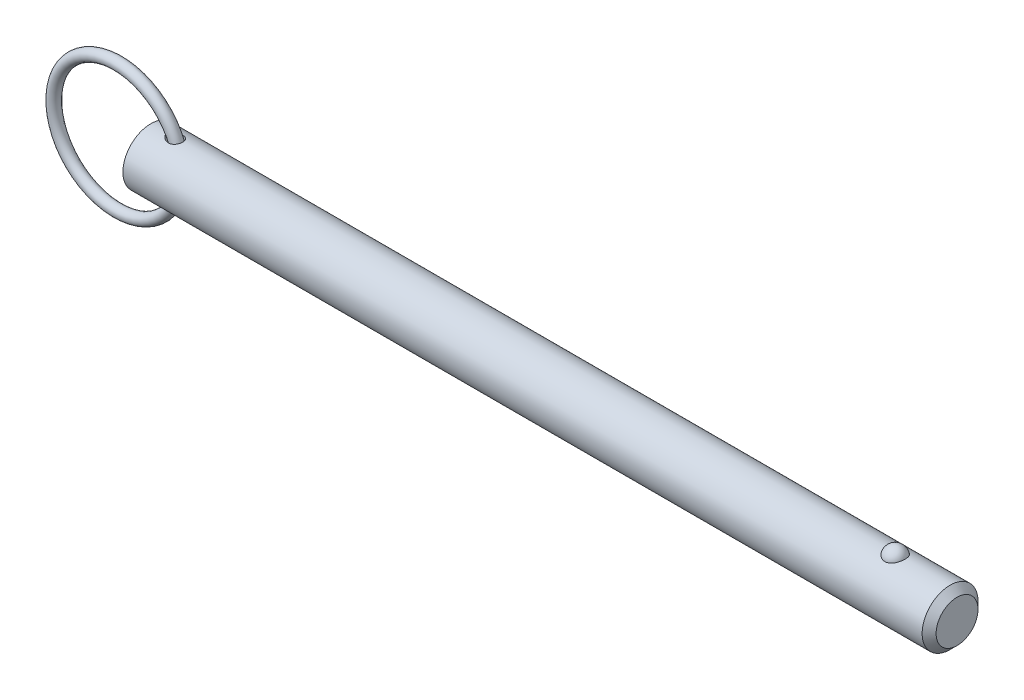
ISO-10303-21;
HEADER;
FILE_DESCRIPTION(('STEP AP214'),'2;1');
FILE_NAME('part.step','',(''),(''),'','','');
FILE_SCHEMA(('AUTOMOTIVE_DESIGN { 1 0 10303 214 1 1 1 1 }'));
ENDSEC;
DATA;
#1=APPLICATION_CONTEXT('core data for automotive mechanical design processes');
#2=APPLICATION_PROTOCOL_DEFINITION('international standard','automotive_design',2000,#1);
#3=PRODUCT_CONTEXT('',#1,'mechanical');
#4=PRODUCT('Part','Part','',(#3));
#5=PRODUCT_RELATED_PRODUCT_CATEGORY('part','',(#4));
#6=PRODUCT_DEFINITION_FORMATION('','',#4);
#7=PRODUCT_DEFINITION_CONTEXT('part definition',#1,'design');
#8=PRODUCT_DEFINITION('design','',#6,#7);
#9=PRODUCT_DEFINITION_SHAPE('','',#8);
#10=(LENGTH_UNIT() NAMED_UNIT(*) SI_UNIT(.MILLI.,.METRE.));
#11=(NAMED_UNIT(*) PLANE_ANGLE_UNIT() SI_UNIT($,.RADIAN.));
#12=(NAMED_UNIT(*) SI_UNIT($,.STERADIAN.) SOLID_ANGLE_UNIT());
#13=UNCERTAINTY_MEASURE_WITH_UNIT(LENGTH_MEASURE(1.E-05),#10,'distance_accuracy_value','');
#14=(GEOMETRIC_REPRESENTATION_CONTEXT(3) GLOBAL_UNCERTAINTY_ASSIGNED_CONTEXT((#13)) GLOBAL_UNIT_ASSIGNED_CONTEXT((#10,
#11,#12)) REPRESENTATION_CONTEXT('',''));
#15=CARTESIAN_POINT('',(0.,0.,0.));
#16=DIRECTION('',(0.,0.,1.));
#17=DIRECTION('',(1.,0.,0.));
#18=AXIS2_PLACEMENT_3D('',#15,#16,#17);
#19=CARTESIAN_POINT('',(-6.5973878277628,0.,0.));
#20=DIRECTION('',(0.,0.,1.));
#21=DIRECTION('',(1.,0.,0.));
#22=AXIS2_PLACEMENT_3D('',#19,#20,#21);
#23=TOROIDAL_SURFACE('',#22,12.7,1.111);
#24=CARTESIAN_POINT('',(7.21361217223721,0.,0.));
#25=VERTEX_POINT('',#24);
#26=VERTEX_LOOP('',#25);
#27=FACE_BOUND('',#26,.T.);
#28=ADVANCED_FACE('P0_F12',(#27),#23,.T.);
#29=CLOSED_SHELL('',(#28));
#30=MANIFOLD_SOLID_BREP('P0_B1',#29);
#31=CARTESIAN_POINT('',(0.,0.,0.));
#32=DIRECTION('',(1.,0.,0.));
#33=DIRECTION('',(0.,0.,-1.));
#34=AXIS2_PLACEMENT_3D('',#31,#32,#33);
#35=CYLINDRICAL_SURFACE('',#34,5.555);
#36=CARTESIAN_POINT('',(3.4079629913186,5.52646850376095,-0.56229074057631));
#37=CARTESIAN_POINT('',(3.45038002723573,5.51879026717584,-0.637753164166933));
#38=CARTESIAN_POINT('',(3.50032814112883,5.50998541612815,-0.70889136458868));
#39=CARTESIAN_POINT('',(3.61174203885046,5.49132550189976,-0.841353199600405));
#40=CARTESIAN_POINT('',(3.67323300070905,5.48146816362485,-0.902654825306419));
#41=CARTESIAN_POINT('',(3.80437942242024,5.46186986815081,-1.01449227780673));
#42=CARTESIAN_POINT('',(3.87396236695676,5.45212862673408,-1.06511378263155));
#43=CARTESIAN_POINT('',(4.01965973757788,5.43359578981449,-1.15594541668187));
#44=CARTESIAN_POINT('',(4.09577226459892,5.42480391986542,-1.19615855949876));
#45=CARTESIAN_POINT('',(4.26620236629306,5.40764958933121,-1.27165209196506));
#46=CARTESIAN_POINT('',(4.36143030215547,5.3996073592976,-1.30496908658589));
#47=CARTESIAN_POINT('',(4.55632904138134,5.38707461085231,-1.35578120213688));
#48=CARTESIAN_POINT('',(4.65600230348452,5.38258608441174,-1.37326745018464));
#49=CARTESIAN_POINT('',(4.85802759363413,5.37803111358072,-1.3910078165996));
#50=CARTESIAN_POINT('',(4.96039620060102,5.37800782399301,-1.39109376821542));
#51=CARTESIAN_POINT('',(5.16321961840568,5.38288845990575,-1.37209481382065));
#52=CARTESIAN_POINT('',(5.2636766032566,5.38778639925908,-1.3530331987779));
#53=CARTESIAN_POINT('',(5.44616808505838,5.40112654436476,-1.29866014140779));
#54=CARTESIAN_POINT('',(5.52893514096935,5.40904875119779,-1.26567968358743));
#55=CARTESIAN_POINT('',(5.68656142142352,5.4273273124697,-1.18484144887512));
#56=CARTESIAN_POINT('',(5.76142575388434,5.43768208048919,-1.13699336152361));
#57=CARTESIAN_POINT('',(5.8928378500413,5.45821422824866,-1.03362464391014));
#58=CARTESIAN_POINT('',(5.95048930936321,5.4682911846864,-0.979480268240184));
#59=CARTESIAN_POINT('',(6.05543937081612,5.48805232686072,-0.861887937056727));
#60=CARTESIAN_POINT('',(6.10274018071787,5.4977365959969,-0.798441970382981));
#61=CARTESIAN_POINT('',(6.18429732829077,5.51527779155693,-0.666351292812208));
#62=CARTESIAN_POINT('',(6.21893047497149,5.52318421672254,-0.597945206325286));
#63=CARTESIAN_POINT('',(6.27643902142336,5.53669785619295,-0.456146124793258));
#64=CARTESIAN_POINT('',(6.299314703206,5.54230512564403,-0.382753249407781));
#65=CARTESIAN_POINT('',(6.33280284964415,5.55061821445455,-0.232999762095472));
#66=CARTESIAN_POINT('',(6.34340498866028,5.55332159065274,-0.156636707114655));
#67=CARTESIAN_POINT('',(6.35208224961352,5.55552923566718,-0.00315477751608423));
#68=CARTESIAN_POINT('',(6.3501570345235,5.55503341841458,0.0739641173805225));
#69=CARTESIAN_POINT('',(6.33379320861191,5.55088854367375,0.22702996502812));
#70=CARTESIAN_POINT('',(6.31931424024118,5.54722931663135,0.302972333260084));
#71=CARTESIAN_POINT('',(6.27810810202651,5.53713917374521,0.451265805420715));
#72=CARTESIAN_POINT('',(6.25138106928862,5.53070828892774,0.523616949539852));
#73=CARTESIAN_POINT('',(6.18634700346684,5.51578851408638,0.662556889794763));
#74=CARTESIAN_POINT('',(6.14805666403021,5.50730259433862,0.729153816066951));
#75=CARTESIAN_POINT('',(6.0608417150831,5.4892059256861,0.854797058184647));
#76=CARTESIAN_POINT('',(6.01191805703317,5.47959527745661,0.91384404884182));
#77=CARTESIAN_POINT('',(5.90496974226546,5.46035411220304,1.0225462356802));
#78=CARTESIAN_POINT('',(5.8469816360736,5.45072382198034,1.07223745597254));
#79=CARTESIAN_POINT('',(5.72342907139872,5.43245016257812,1.16128533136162));
#80=CARTESIAN_POINT('',(5.65786492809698,5.42380675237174,1.20064241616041));
#81=CARTESIAN_POINT('',(5.52033184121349,5.40830592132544,1.26865612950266));
#82=CARTESIAN_POINT('',(5.44830127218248,5.40146883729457,1.2971923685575));
#83=CARTESIAN_POINT('',(5.30051649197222,5.39032432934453,1.34275086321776));
#84=CARTESIAN_POINT('',(5.2247613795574,5.38601752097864,1.35977031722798));
#85=CARTESIAN_POINT('',(5.06697568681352,5.38004503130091,1.3832203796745));
#86=CARTESIAN_POINT('',(4.98483834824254,5.37854992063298,1.38896799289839));
#87=CARTESIAN_POINT('',(4.82062075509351,5.37866467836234,1.38851901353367));
#88=CARTESIAN_POINT('',(4.73854053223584,5.38027567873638,1.38231806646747));
#89=CARTESIAN_POINT('',(4.5665970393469,5.38661928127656,1.35740374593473));
#90=CARTESIAN_POINT('',(4.47694676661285,5.39169506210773,1.33731128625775));
#91=CARTESIAN_POINT('',(4.30168169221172,5.40457769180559,1.28425210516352));
#92=CARTESIAN_POINT('',(4.2160714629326,5.41238755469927,1.25127117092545));
#93=CARTESIAN_POINT('',(4.04117722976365,5.43085841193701,1.16867508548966));
#94=CARTESIAN_POINT('',(3.95261220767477,5.44174460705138,1.11757796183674));
#95=CARTESIAN_POINT('',(3.78568183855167,5.46440376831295,1.00091858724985));
#96=CARTESIAN_POINT('',(3.70730710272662,5.47617590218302,0.935369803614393));
#97=CARTESIAN_POINT('',(3.5829937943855,5.49603821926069,0.809043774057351));
#98=CARTESIAN_POINT('',(3.5339020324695,5.50429522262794,0.751392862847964));
#99=CARTESIAN_POINT('',(3.44556991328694,5.51963490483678,0.628847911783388));
#100=CARTESIAN_POINT('',(3.40631385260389,5.52671944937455,0.563965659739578));
#101=CARTESIAN_POINT('',(3.34553998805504,5.5379053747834,0.439181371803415));
#102=CARTESIAN_POINT('',(3.32216705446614,5.5423057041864,0.380214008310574));
#103=CARTESIAN_POINT('',(3.28543686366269,5.54928356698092,0.259119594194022));
#104=CARTESIAN_POINT('',(3.27207322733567,5.5518622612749,0.196994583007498));
#105=CARTESIAN_POINT('',(3.25633559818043,5.5549036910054,0.0710541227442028));
#106=CARTESIAN_POINT('',(3.25400356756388,5.5553583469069,0.00723314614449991));
#107=CARTESIAN_POINT('',(3.26064251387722,5.55407150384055,-0.119787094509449));
#108=CARTESIAN_POINT('',(3.26961302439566,5.55233009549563,-0.182986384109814));
#109=CARTESIAN_POINT('',(3.29666795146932,5.54714559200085,-0.300518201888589));
#110=CARTESIAN_POINT('',(3.31373453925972,5.54389322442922,-0.355099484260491));
#111=CARTESIAN_POINT('',(3.35543396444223,5.53607951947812,-0.461174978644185));
#112=CARTESIAN_POINT('',(3.38007019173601,5.5315175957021,-0.512667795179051));
#113=CARTESIAN_POINT('',(3.4079629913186,5.52646850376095,-0.56229074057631));
#114=B_SPLINE_CURVE_WITH_KNOTS('',3,(#36,#37,#38,#39,#40,#41,#42,#43,#44,#45,#46,#47,#48,#49,
#50,#51,#52,#53,#54,#55,#56,#57,#58,#59,#60,#61,#62,#63,#64,#65,#66,#67,#68,#69,#70,#71,#72,#73,
#74,#75,#76,#77,#78,#79,#80,#81,#82,#83,#84,#85,#86,#87,#88,#89,#90,#91,#92,#93,#94,#95,#96,#97,
#98,#99,#100,#101,#102,#103,#104,#105,#106,#107,#108,#109,#110,#111,#112,#113),.UNSPECIFIED.,
.T.,.F.,(4,2,2,2,2,2,2,2,2,2,2,2,2,2,2,2,2,2,2,2,2,2,2,2,2,2,2,2,2,2,2,2,2,2,2,2,2,2,4),(0.,
0.260459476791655,0.521493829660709,0.780346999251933,1.03912513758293,1.34137402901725,
1.64379222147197,1.94913302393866,2.25410286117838,2.52092363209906,2.78757087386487,
3.02557563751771,3.26352958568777,3.49368251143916,3.72382991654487,3.9541708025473,
4.18451788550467,4.41560824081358,4.64669600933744,4.87745174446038,5.10818684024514,
5.33801446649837,5.56783253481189,5.80013729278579,6.03249854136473,6.27855081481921,
6.5246927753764,6.79963372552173,7.07487872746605,7.38193573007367,7.68870779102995,
7.91639390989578,8.14371416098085,8.33366541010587,8.52349549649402,8.71404708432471,
8.90459080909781,9.07578823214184,9.24706243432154),.UNSPECIFIED.);
#115=CARTESIAN_POINT('',(3.4079629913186,5.52646850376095,-0.56229074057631));
#116=VERTEX_POINT('',#115);
#117=EDGE_CURVE('P1_E40',#116,#116,#114,.T.);
#118=ORIENTED_EDGE('',*,*,#117,.T.);
#119=EDGE_LOOP('',(#118));
#120=FACE_BOUND('',#119,.T.);
#121=CARTESIAN_POINT('',(158.93125,0.,0.));
#122=DIRECTION('',(1.,0.,0.));
#123=DIRECTION('',(0.,0.,-1.));
#124=AXIS2_PLACEMENT_3D('',#121,#122,#123);
#125=CIRCLE('',#124,5.555);
#126=CARTESIAN_POINT('',(158.93125,0.,-5.555));
#127=VERTEX_POINT('',#126);
#128=EDGE_CURVE('P1_E25',#127,#127,#125,.T.);
#129=ORIENTED_EDGE('',*,*,#128,.F.);
#130=EDGE_LOOP('',(#129));
#131=FACE_BOUND('',#130,.T.);
#132=CARTESIAN_POINT('',(0.,0.,0.));
#133=DIRECTION('',(1.,0.,0.));
#134=DIRECTION('',(0.,0.,-1.));
#135=AXIS2_PLACEMENT_3D('',#132,#133,#134);
#136=CIRCLE('',#135,5.555);
#137=CARTESIAN_POINT('',(0.,0.,-5.555));
#138=VERTEX_POINT('',#137);
#139=EDGE_CURVE('P1_E9',#138,#138,#136,.T.);
#140=ORIENTED_EDGE('',*,*,#139,.T.);
#141=EDGE_LOOP('',(#140));
#142=FACE_BOUND('',#141,.T.);
#143=CARTESIAN_POINT('',(148.018626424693,5.16741224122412,2.03859650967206));
#144=CARTESIAN_POINT('',(147.912949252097,5.16740893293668,2.03859990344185));
#145=CARTESIAN_POINT('',(147.80729894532,5.17079470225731,2.03008306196));
#146=CARTESIAN_POINT('',(147.599141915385,5.18392795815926,1.99630721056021));
#147=CARTESIAN_POINT('',(147.496634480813,5.19367399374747,1.97105201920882));
#148=CARTESIAN_POINT('',(147.297771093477,5.21839168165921,1.90463997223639));
#149=CARTESIAN_POINT('',(147.201406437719,5.23335573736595,1.8635062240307));
#150=CARTESIAN_POINT('',(147.017080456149,5.26688076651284,1.76652592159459));
#151=CARTESIAN_POINT('',(146.929120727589,5.28544242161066,1.71067657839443));
#152=CARTESIAN_POINT('',(146.761265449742,5.32479845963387,1.58399959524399));
#153=CARTESIAN_POINT('',(146.68166564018,5.34564089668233,1.51279545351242));
#154=CARTESIAN_POINT('',(146.53512901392,5.38697258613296,1.35828584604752));
#155=CARTESIAN_POINT('',(146.468194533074,5.40746177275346,1.27497815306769));
#156=CARTESIAN_POINT('',(146.34561039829,5.44694508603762,1.0944029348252));
#157=CARTESIAN_POINT('',(146.290598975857,5.46583143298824,0.996677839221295));
#158=CARTESIAN_POINT('',(146.196937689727,5.49908030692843,0.792961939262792));
#159=CARTESIAN_POINT('',(146.158289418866,5.513442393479,0.686970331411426));
#160=CARTESIAN_POINT('',(146.097680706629,5.53635851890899,0.468019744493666));
#161=CARTESIAN_POINT('',(146.075972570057,5.54482455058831,0.354981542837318));
#162=CARTESIAN_POINT('',(146.050636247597,5.55473324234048,0.126595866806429));
#163=CARTESIAN_POINT('',(146.047007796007,5.55617600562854,0.0112484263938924));
#164=CARTESIAN_POINT('',(146.057881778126,5.55189984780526,-0.218011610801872));
#165=CARTESIAN_POINT('',(146.072315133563,5.54620821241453,-0.331928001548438));
#166=CARTESIAN_POINT('',(146.118903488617,5.52828920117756,-0.555544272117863));
#167=CARTESIAN_POINT('',(146.151058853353,5.5160616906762,-0.665244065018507));
#168=CARTESIAN_POINT('',(146.232488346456,5.48630779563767,-0.877469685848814));
#169=CARTESIAN_POINT('',(146.281781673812,5.4687754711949,-0.979987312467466));
#170=CARTESIAN_POINT('',(146.396478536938,5.43024700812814,-1.17486975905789));
#171=CARTESIAN_POINT('',(146.461883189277,5.4092506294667,-1.26723387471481));
#172=CARTESIAN_POINT('',(146.607571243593,5.36600927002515,-1.4394013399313));
#173=CARTESIAN_POINT('',(146.687885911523,5.34376173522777,-1.51917763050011));
#174=CARTESIAN_POINT('',(146.861452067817,5.30057971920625,-1.66360338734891));
#175=CARTESIAN_POINT('',(146.954702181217,5.27964509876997,-1.72825445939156));
#176=CARTESIAN_POINT('',(147.149393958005,5.24205250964,-1.83909478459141));
#177=CARTESIAN_POINT('',(147.250590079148,5.22530519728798,-1.88568407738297));
#178=CARTESIAN_POINT('',(147.460155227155,5.19750919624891,-1.96100802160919));
#179=CARTESIAN_POINT('',(147.568521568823,5.1864583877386,-1.98974931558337));
#180=CARTESIAN_POINT('',(147.783498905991,5.17184410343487,-2.02742262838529));
#181=CARTESIAN_POINT('',(147.889925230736,5.1679328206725,-2.03727608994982));
#182=CARTESIAN_POINT('',(148.102992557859,5.16698995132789,-2.03966777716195));
#183=CARTESIAN_POINT('',(148.209633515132,5.16995704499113,-2.03220932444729));
#184=CARTESIAN_POINT('',(148.416773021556,5.18222383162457,-2.00071170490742));
#185=CARTESIAN_POINT('',(148.517359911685,5.19133213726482,-1.97717337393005));
#186=CARTESIAN_POINT('',(148.713014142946,5.21467637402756,-1.91475248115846));
#187=CARTESIAN_POINT('',(148.808081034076,5.22891272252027,-1.87586867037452));
#188=CARTESIAN_POINT('',(148.992371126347,5.26137066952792,-1.78282713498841));
#189=CARTESIAN_POINT('',(149.081419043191,5.27967329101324,-1.72835124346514));
#190=CARTESIAN_POINT('',(149.249288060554,5.3181741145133,-1.60597483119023));
#191=CARTESIAN_POINT('',(149.328106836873,5.33837274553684,-1.5380712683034));
#192=CARTESIAN_POINT('',(149.477515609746,5.37968287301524,-1.38688970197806));
#193=CARTESIAN_POINT('',(149.547505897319,5.40079011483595,-1.30301744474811));
#194=CARTESIAN_POINT('',(149.673012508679,5.44074401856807,-1.12458170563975));
#195=CARTESIAN_POINT('',(149.728526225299,5.45959027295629,-1.03001630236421));
#196=CARTESIAN_POINT('',(149.825550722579,5.49369849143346,-0.829439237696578));
#197=CARTESIAN_POINT('',(149.866548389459,5.50882422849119,-0.723155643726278));
#198=CARTESIAN_POINT('',(149.931125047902,5.53310911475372,-0.504772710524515));
#199=CARTESIAN_POINT('',(149.954703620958,5.54226812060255,-0.392673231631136));
#200=CARTESIAN_POINT('',(149.984013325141,5.55370358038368,-0.165459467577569));
#201=CARTESIAN_POINT('',(149.989688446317,5.55595843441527,-0.0503368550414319));
#202=CARTESIAN_POINT('',(149.982916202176,5.55329317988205,0.179288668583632));
#203=CARTESIAN_POINT('',(149.970469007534,5.54837313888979,0.293791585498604));
#204=CARTESIAN_POINT('',(149.927779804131,5.53189037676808,0.518526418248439));
#205=CARTESIAN_POINT('',(149.897598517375,5.5203503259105,0.628771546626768));
#206=CARTESIAN_POINT('',(149.820096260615,5.49182453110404,0.84231815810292));
#207=CARTESIAN_POINT('',(149.772774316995,5.47483847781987,0.945619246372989));
#208=CARTESIAN_POINT('',(149.661720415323,5.43710633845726,1.14281571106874));
#209=CARTESIAN_POINT('',(149.597921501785,5.41634501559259,1.23667048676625));
#210=CARTESIAN_POINT('',(149.455357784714,5.37334572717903,1.4118524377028));
#211=CARTESIAN_POINT('',(149.37659323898,5.35110778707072,1.49317982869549));
#212=CARTESIAN_POINT('',(149.206423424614,5.30779474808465,1.64049162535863));
#213=CARTESIAN_POINT('',(149.11510026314,5.28671324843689,1.7065687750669));
#214=CARTESIAN_POINT('',(148.921739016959,5.24804852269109,1.82201372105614));
#215=CARTESIAN_POINT('',(148.819700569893,5.23046541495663,1.87138095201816));
#216=CARTESIAN_POINT('',(148.603618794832,5.20042692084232,1.95335298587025));
#217=CARTESIAN_POINT('',(148.489260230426,5.18820192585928,1.98521734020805));
#218=CARTESIAN_POINT('',(148.256130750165,5.17169804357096,2.02783294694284));
#219=CARTESIAN_POINT('',(148.137361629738,5.16741595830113,2.03859269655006));
#220=CARTESIAN_POINT('',(148.018626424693,5.16741224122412,2.03859650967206));
#221=B_SPLINE_CURVE_WITH_KNOTS('',3,(#143,#144,#145,#146,#147,#148,#149,#150,#151,#152,#153,
#154,#155,#156,#157,#158,#159,#160,#161,#162,#163,#164,#165,#166,#167,#168,#169,#170,#171,#172,
#173,#174,#175,#176,#177,#178,#179,#180,#181,#182,#183,#184,#185,#186,#187,#188,#189,#190,#191,
#192,#193,#194,#195,#196,#197,#198,#199,#200,#201,#202,#203,#204,#205,#206,#207,#208,#209,#210,
#211,#212,#213,#214,#215,#216,#217,#218,#219,#220),.UNSPECIFIED.,.T.,.F.,(4,2,2,2,2,2,2,2,2,2,2,
2,2,2,2,2,2,2,2,2,2,2,2,2,2,2,2,2,2,2,2,2,2,2,2,2,2,2,4),(0.,0.316595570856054,
0.633118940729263,0.94918341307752,1.26530783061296,1.59030762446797,1.91536729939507,
2.25495824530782,2.59458224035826,2.93917283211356,3.28375835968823,3.62703002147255,
3.97030875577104,4.31397329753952,4.657661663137,5.00207904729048,5.34645984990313,
5.68270547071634,6.01882587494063,6.33808403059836,6.65728093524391,6.96696376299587,
7.27667180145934,7.59321535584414,7.90983070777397,8.24210387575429,8.57443684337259,
8.91755896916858,9.26068933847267,9.60489211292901,9.94909164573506,10.2921194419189,
10.6351667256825,10.9796305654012,11.3240884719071,11.6663928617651,12.0087088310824,
12.3645679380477,12.7202837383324),.UNSPECIFIED.);
#222=CARTESIAN_POINT('',(148.018626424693,5.16741224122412,2.03859650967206));
#223=VERTEX_POINT('',#222);
#224=EDGE_CURVE('P1_E34',#223,#223,#221,.T.);
#225=ORIENTED_EDGE('',*,*,#224,.T.);
#226=EDGE_LOOP('',(#225));
#227=FACE_BOUND('',#226,.T.);
#228=CARTESIAN_POINT('',(3.4079629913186,-5.52646850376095,-0.56229074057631));
#229=CARTESIAN_POINT('',(3.37716927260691,-5.53204268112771,-0.507507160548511));
#230=CARTESIAN_POINT('',(3.35034276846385,-5.53702335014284,-0.450440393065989));
#231=CARTESIAN_POINT('',(3.30606625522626,-5.54534377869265,-0.3326552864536));
#232=CARTESIAN_POINT('',(3.28860803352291,-5.5486849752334,-0.271940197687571));
#233=CARTESIAN_POINT('',(3.26421203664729,-5.55337514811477,-0.148013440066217));
#234=CARTESIAN_POINT('',(3.25732647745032,-5.55471423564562,-0.0847909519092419));
#235=CARTESIAN_POINT('',(3.25480623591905,-5.5552029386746,0.0418913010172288));
#236=CARTESIAN_POINT('',(3.25917102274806,-5.55435265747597,0.105351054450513));
#237=CARTESIAN_POINT('',(3.27824306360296,-5.55067444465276,0.227039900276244));
#238=CARTESIAN_POINT('',(3.29237198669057,-5.54795714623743,0.285365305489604));
#239=CARTESIAN_POINT('',(3.32941044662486,-5.54094262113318,0.399033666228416));
#240=CARTESIAN_POINT('',(3.3523223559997,-5.53664496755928,0.454375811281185));
#241=CARTESIAN_POINT('',(3.40768868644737,-5.52648234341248,0.56509977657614));
#242=CARTESIAN_POINT('',(3.4407252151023,-5.52052470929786,0.620179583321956));
#243=CARTESIAN_POINT('',(3.51400705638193,-5.50771567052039,0.725188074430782));
#244=CARTESIAN_POINT('',(3.55425830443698,-5.50086353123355,0.775112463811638));
#245=CARTESIAN_POINT('',(3.66122818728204,-5.48337209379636,0.891977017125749));
#246=CARTESIAN_POINT('',(3.73142715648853,-5.47248221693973,0.955709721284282));
#247=CARTESIAN_POINT('',(3.88137100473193,-5.45112279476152,1.07085228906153));
#248=CARTESIAN_POINT('',(3.96113047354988,-5.44065392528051,1.12224294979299));
#249=CARTESIAN_POINT('',(4.12858826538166,-5.42121387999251,1.21269344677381));
#250=CARTESIAN_POINT('',(4.21635930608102,-5.41225908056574,1.25162207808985));
#251=CARTESIAN_POINT('',(4.39702156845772,-5.39704895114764,1.31566440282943));
#252=CARTESIAN_POINT('',(4.48991226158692,-5.39079334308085,1.34077951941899));
#253=CARTESIAN_POINT('',(4.68604255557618,-5.38154547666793,1.37745897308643));
#254=CARTESIAN_POINT('',(4.78952677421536,-5.37884317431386,1.38782444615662));
#255=CARTESIAN_POINT('',(4.9967070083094,-5.3783992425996,1.38955482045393));
#256=CARTESIAN_POINT('',(5.10040282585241,-5.380654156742,1.380932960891));
#257=CARTESIAN_POINT('',(5.29344112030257,-5.3896561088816,1.34533259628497));
#258=CARTESIAN_POINT('',(5.38316618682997,-5.39591960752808,1.32032381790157));
#259=CARTESIAN_POINT('',(5.55593681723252,-5.41176992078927,1.25376768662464));
#260=CARTESIAN_POINT('',(5.63898852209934,-5.42135363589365,1.2122357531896));
#261=CARTESIAN_POINT('',(5.78518175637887,-5.4411584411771,1.1197110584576));
#262=CARTESIAN_POINT('',(5.84951468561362,-5.45115126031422,1.07054233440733));
#263=CARTESIAN_POINT('',(5.96832363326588,-5.47143247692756,0.961516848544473));
#264=CARTESIAN_POINT('',(6.02280238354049,-5.48172079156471,0.901663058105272));
#265=CARTESIAN_POINT('',(6.11773365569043,-5.50082367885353,0.776380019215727));
#266=CARTESIAN_POINT('',(6.15876077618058,-5.50968670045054,0.711392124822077));
#267=CARTESIAN_POINT('',(6.22940016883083,-5.52555592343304,0.575278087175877));
#268=CARTESIAN_POINT('',(6.25901321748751,-5.53256225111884,0.504152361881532));
#269=CARTESIAN_POINT('',(6.30603044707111,-5.54392803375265,0.35809068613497));
#270=CARTESIAN_POINT('',(6.32348246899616,-5.54829785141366,0.283170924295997));
#271=CARTESIAN_POINT('',(6.34598368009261,-5.5539654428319,0.131376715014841));
#272=CARTESIAN_POINT('',(6.35103253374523,-5.55526313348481,0.054502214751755));
#273=CARTESIAN_POINT('',(6.34861245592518,-5.55464639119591,-0.0993401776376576));
#274=CARTESIAN_POINT('',(6.34109421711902,-5.5527193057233,-0.176307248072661));
#275=CARTESIAN_POINT('',(6.31360904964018,-5.54583593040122,-0.327847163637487));
#276=CARTESIAN_POINT('',(6.29364207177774,-5.54087962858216,-0.402419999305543));
#277=CARTESIAN_POINT('',(6.24170966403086,-5.52847553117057,-0.54704108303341));
#278=CARTESIAN_POINT('',(6.20974488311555,-5.52102787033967,-0.617089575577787));
#279=CARTESIAN_POINT('',(6.13458425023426,-5.5044595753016,-0.750655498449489));
#280=CARTESIAN_POINT('',(6.09138916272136,-5.49533905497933,-0.814173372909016));
#281=CARTESIAN_POINT('',(5.99508306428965,-5.47647644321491,-0.932642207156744));
#282=CARTESIAN_POINT('',(5.94201288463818,-5.46673701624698,-0.987626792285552));
#283=CARTESIAN_POINT('',(5.82732079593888,-5.4476756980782,-1.08787197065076));
#284=CARTESIAN_POINT('',(5.76569959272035,-5.43835377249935,-1.133133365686));
#285=CARTESIAN_POINT('',(5.63545565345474,-5.42108746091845,-1.2130627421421));
#286=CARTESIAN_POINT('',(5.56680798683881,-5.41314827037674,-1.24769112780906));
#287=CARTESIAN_POINT('',(5.42470366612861,-5.39946749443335,-1.30562834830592));
#288=CARTESIAN_POINT('',(5.3512462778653,-5.39372624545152,-1.32893545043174));
#289=CARTESIAN_POINT('',(5.19834649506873,-5.38471871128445,-1.36498831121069));
#290=CARTESIAN_POINT('',(5.11878242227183,-5.38156800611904,-1.37724301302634));
#291=CARTESIAN_POINT('',(4.95867408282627,-5.37830368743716,-1.38993264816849));
#292=CARTESIAN_POINT('',(4.87812945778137,-5.37819121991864,-1.39036312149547));
#293=CARTESIAN_POINT('',(4.70952450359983,-5.38096665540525,-1.37958681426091));
#294=CARTESIAN_POINT('',(4.62154757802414,-5.38416579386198,-1.36717293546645));
#295=CARTESIAN_POINT('',(4.44844201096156,-5.39350862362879,-1.32983172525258));
#296=CARTESIAN_POINT('',(4.36331534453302,-5.39965431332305,-1.30489590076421));
#297=CARTESIAN_POINT('',(4.18705584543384,-5.41508127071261,-1.23943340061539));
#298=CARTESIAN_POINT('',(4.09653169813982,-5.42466147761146,-1.19732979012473));
#299=CARTESIAN_POINT('',(3.92355621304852,-5.44542654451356,-1.09903394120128));
#300=CARTESIAN_POINT('',(3.84111059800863,-5.45661252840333,-1.04283181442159));
#301=CARTESIAN_POINT('',(3.69303712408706,-5.47835672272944,-0.921492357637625));
#302=CARTESIAN_POINT('',(3.62661543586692,-5.4888999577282,-0.857326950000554));
#303=CARTESIAN_POINT('',(3.50663841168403,-5.50887375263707,-0.717815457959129));
#304=CARTESIAN_POINT('',(3.45304856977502,-5.51830726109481,-0.642500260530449));
#305=CARTESIAN_POINT('',(3.4079629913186,-5.52646850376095,-0.56229074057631));
#306=B_SPLINE_CURVE_WITH_KNOTS('',3,(#228,#229,#230,#231,#232,#233,#234,#235,#236,#237,#238,
#239,#240,#241,#242,#243,#244,#245,#246,#247,#248,#249,#250,#251,#252,#253,#254,#255,#256,#257,
#258,#259,#260,#261,#262,#263,#264,#265,#266,#267,#268,#269,#270,#271,#272,#273,#274,#275,#276,
#277,#278,#279,#280,#281,#282,#283,#284,#285,#286,#287,#288,#289,#290,#291,#292,#293,#294,#295,
#296,#297,#298,#299,#300,#301,#302,#303,#304,#305),.UNSPECIFIED.,.T.,.F.,(4,2,2,2,2,2,2,2,2,2,2,
2,2,2,2,2,2,2,2,2,2,2,2,2,2,2,2,2,2,2,2,2,2,2,2,2,2,2,4),(0.,0.189054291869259,
0.377942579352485,0.567760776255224,0.757570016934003,0.937004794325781,1.11648807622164,
1.30929480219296,1.50226088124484,1.78704908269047,2.07227755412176,2.3604171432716,
2.64852704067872,2.95892962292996,3.26911584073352,3.5475451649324,3.82571526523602,
4.06921935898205,4.31265584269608,4.54364944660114,4.77462733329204,5.00469135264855,
5.23476159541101,5.46573664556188,5.69671260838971,5.92767607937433,6.15862383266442,
6.38863707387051,6.61863134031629,6.84947196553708,7.08034790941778,7.32103794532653,
7.56181876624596,7.82747997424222,8.09332161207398,8.39289891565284,8.69268692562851,
8.97023931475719,9.24703674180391),.UNSPECIFIED.);
#307=CARTESIAN_POINT('',(3.4079629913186,-5.52646850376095,-0.56229074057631));
#308=VERTEX_POINT('',#307);
#309=EDGE_CURVE('P1_E17',#308,#308,#306,.T.);
#310=ORIENTED_EDGE('',*,*,#309,.T.);
#311=EDGE_LOOP('',(#310));
#312=FACE_BOUND('',#311,.T.);
#313=ADVANCED_FACE('P1_F13',(#120,#131,#142,#227,#312),#35,.T.);
#314=CARTESIAN_POINT('',(0.,0.,0.));
#315=DIRECTION('',(-1.,0.,0.));
#316=DIRECTION('',(0.,0.,1.));
#317=AXIS2_PLACEMENT_3D('',#314,#315,#316);
#318=PLANE('',#317);
#319=ORIENTED_EDGE('',*,*,#139,.F.);
#320=EDGE_LOOP('',(#319));
#321=FACE_BOUND('',#320,.T.);
#322=ADVANCED_FACE('P1_F15',(#321),#318,.T.);
#323=CARTESIAN_POINT('',(160.32,0.,0.));
#324=DIRECTION('',(-1.,0.,0.));
#325=DIRECTION('',(0.,0.,1.));
#326=AXIS2_PLACEMENT_3D('',#323,#324,#325);
#327=CONICAL_SURFACE('',#326,4.16625000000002,0.785398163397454);
#328=ORIENTED_EDGE('',*,*,#128,.T.);
#329=EDGE_LOOP('',(#328));
#330=FACE_BOUND('',#329,.T.);
#331=CARTESIAN_POINT('',(160.32,0.,0.));
#332=DIRECTION('',(1.,0.,0.));
#333=DIRECTION('',(0.,0.,-1.));
#334=AXIS2_PLACEMENT_3D('',#331,#332,#333);
#335=CIRCLE('',#334,4.16625000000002);
#336=CARTESIAN_POINT('',(160.32,0.,-4.16625000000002));
#337=VERTEX_POINT('',#336);
#338=EDGE_CURVE('P1_E30',#337,#337,#335,.T.);
#339=ORIENTED_EDGE('',*,*,#338,.F.);
#340=EDGE_LOOP('',(#339));
#341=FACE_BOUND('',#340,.T.);
#342=ADVANCED_FACE('P1_F55',(#330,#341),#327,.T.);
#343=CARTESIAN_POINT('',(160.32,4.16625000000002,0.));
#344=DIRECTION('',(1.,0.,0.));
#345=DIRECTION('',(0.,0.,-1.));
#346=AXIS2_PLACEMENT_3D('',#343,#344,#345);
#347=PLANE('',#346);
#348=ORIENTED_EDGE('',*,*,#338,.T.);
#349=EDGE_LOOP('',(#348));
#350=FACE_BOUND('',#349,.T.);
#351=ADVANCED_FACE('P1_F51',(#350),#347,.T.);
#352=CARTESIAN_POINT('',(148.018626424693,4.9995,0.));
#353=DIRECTION('',(-1.,0.,0.));
#354=DIRECTION('',(0.,1.,0.));
#355=AXIS2_PLACEMENT_3D('',#352,#353,#354);
#356=SPHERICAL_SURFACE('',#355,2.04550000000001);
#357=ORIENTED_EDGE('',*,*,#224,.F.);
#358=EDGE_LOOP('',(#357));
#359=FACE_BOUND('',#358,.T.);
#360=ADVANCED_FACE('P1_F46',(#359),#356,.T.);
#361=CARTESIAN_POINT('',(-6.5973878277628,0.,0.));
#362=DIRECTION('',(0.,0.,1.));
#363=DIRECTION('',(1.,0.,0.));
#364=AXIS2_PLACEMENT_3D('',#361,#362,#363);
#365=TOROIDAL_SURFACE('',#364,12.7,1.38875);
#366=ORIENTED_EDGE('',*,*,#309,.F.);
#367=EDGE_LOOP('',(#366));
#368=FACE_BOUND('',#367,.T.);
#369=ORIENTED_EDGE('',*,*,#117,.F.);
#370=EDGE_LOOP('',(#369));
#371=FACE_BOUND('',#370,.T.);
#372=ADVANCED_FACE('P1_F50',(#368,#371),#365,.F.);
#373=CLOSED_SHELL('',(#313,#322,#342,#351,#360,#372));
#374=MANIFOLD_SOLID_BREP('P1_B1',#373);
#375=ADVANCED_BREP_SHAPE_REPRESENTATION('',(#18,#30,#374),#14);
#376=SHAPE_DEFINITION_REPRESENTATION(#9,#375);
ENDSEC;
END-ISO-10303-21;
